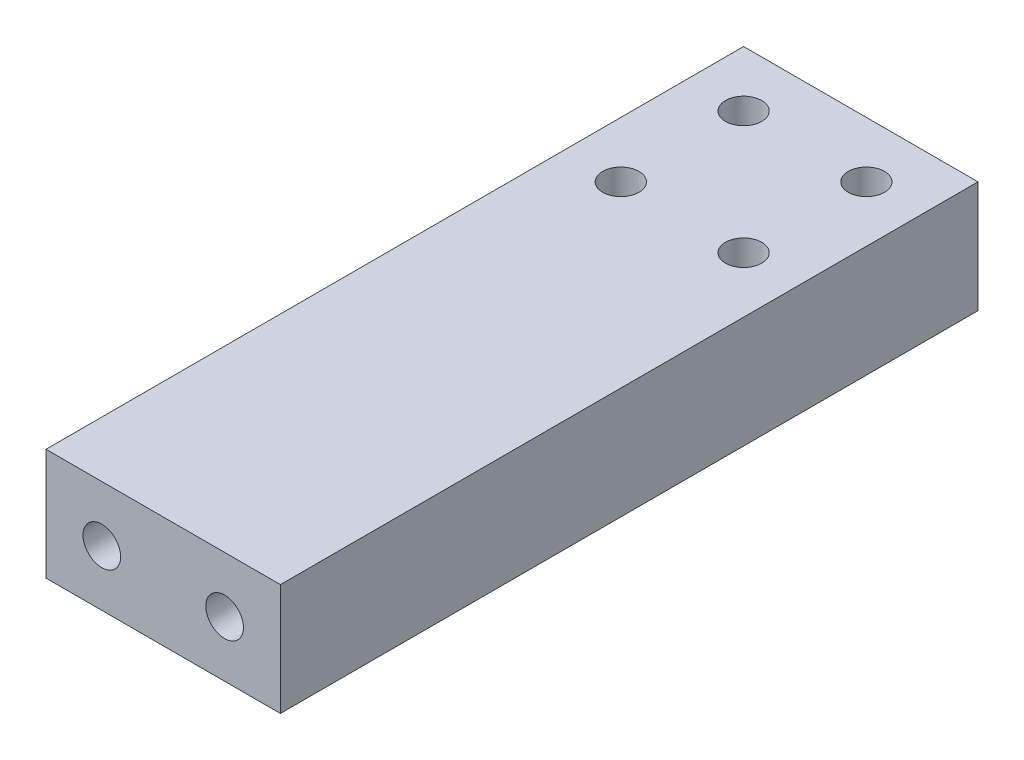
from build123d import *

# Parameters (mm, degrees)
ESQUISSE1_W             = 42
ESQUISSE1_H             = 20
BASE_EXTRUSION_DEPTH    = 125
ENL_V_MAT_EXTRU_1_REACH = 135.375
ESQUISSE2_R             = 3.25
ESQUISSE3_R             = 3.375
ENL_V_MAT_EXTRU_2_DEPTH = 25


with BuildPart() as part:
    # Esquisse1 → Base-Extrusion (new body)
    with BuildSketch(Plane.XY):
        with Locations((21, 10)):
            Rectangle(ESQUISSE1_W, ESQUISSE1_H)
    extrude(amount=BASE_EXTRUSION_DEPTH)

    # Esquisse2 → Enl_v. mat.-Extru.1 (cut, up to next)
    with BuildSketch(Plane(origin=(0, 20, 0), x_dir=(-1, 0, 0), z_dir=(0, 1, 0)), mode=Mode.PRIVATE) as enl_v_mat_extru_1_sk1:
        with Locations(Location((-10, 10, 0), (0, 0, 90))):
            Circle(ESQUISSE2_R)
    enl_v_mat_extru_1_tool1 = extrude(enl_v_mat_extru_1_sk1.sketch, amount=-ENL_V_MAT_EXTRU_1_REACH, mode=Mode.PRIVATE) & part.part
    # Esquisse2 → Enl_v. mat.-Extru.1 (cut, up to next)
    with BuildSketch(Plane(origin=(0, 20, 0), x_dir=(-1, 0, 0), z_dir=(0, 1, 0)), mode=Mode.PRIVATE) as enl_v_mat_extru_1_sk2:
        with Locations(Location((-32, 10, 0), (0, 0, 90))):
            Circle(ESQUISSE2_R)
    enl_v_mat_extru_1_tool2 = extrude(enl_v_mat_extru_1_sk2.sketch, amount=-ENL_V_MAT_EXTRU_1_REACH, mode=Mode.PRIVATE) & part.part
    # Esquisse2 → Enl_v. mat.-Extru.1 (cut, up to next)
    with BuildSketch(Plane(origin=(0, 20, 0), x_dir=(-1, 0, 0), z_dir=(0, 1, 0)), mode=Mode.PRIVATE) as enl_v_mat_extru_1_sk3:
        with Locations(Location((-10, 32, 0), (0, 0, 90))):
            Circle(ESQUISSE2_R)
    enl_v_mat_extru_1_tool3 = extrude(enl_v_mat_extru_1_sk3.sketch, amount=-ENL_V_MAT_EXTRU_1_REACH, mode=Mode.PRIVATE) & part.part
    # Esquisse2 → Enl_v. mat.-Extru.1 (cut, up to next)
    with BuildSketch(Plane(origin=(0, 20, 0), x_dir=(-1, 0, 0), z_dir=(0, 1, 0)), mode=Mode.PRIVATE) as enl_v_mat_extru_1_sk4:
        with Locations(Location((-32, 32, 0), (0, 0, 90))):
            Circle(ESQUISSE2_R)
    enl_v_mat_extru_1_tool4 = extrude(enl_v_mat_extru_1_sk4.sketch, amount=-ENL_V_MAT_EXTRU_1_REACH, mode=Mode.PRIVATE) & part.part
    add(enl_v_mat_extru_1_tool1.solids().sort_by_distance((10, 20, 10))[0], mode=Mode.SUBTRACT)
    add(enl_v_mat_extru_1_tool2.solids().sort_by_distance((32, 20, 10))[0], mode=Mode.SUBTRACT)
    add(enl_v_mat_extru_1_tool3.solids().sort_by_distance((10, 20, 32))[0], mode=Mode.SUBTRACT)
    add(enl_v_mat_extru_1_tool4.solids().sort_by_distance((32, 20, 32))[0], mode=Mode.SUBTRACT)

    # Esquisse3 → Enl_v. mat.-Extru.2 (cut)
    with BuildSketch(Plane.XY.offset(125)):
        with Locations((10, 10)):
            Circle(ESQUISSE3_R)
        with Locations((32, 10)):
            Circle(ESQUISSE3_R)
    extrude(amount=-ENL_V_MAT_EXTRU_2_DEPTH, mode=Mode.SUBTRACT)


solid = part.part
